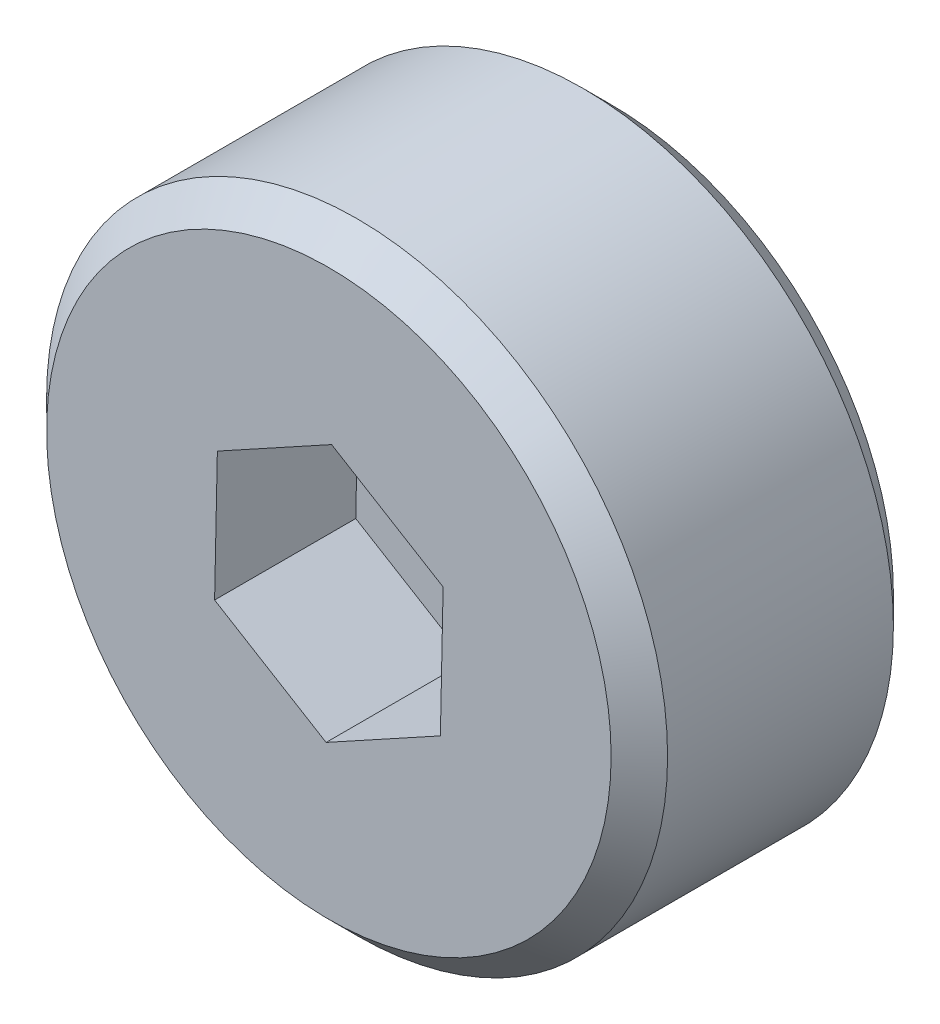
ISO-10303-21;
HEADER;
FILE_DESCRIPTION(('STEP AP214'),'2;1');
FILE_NAME('part.step','',(''),(''),'','','');
FILE_SCHEMA(('AUTOMOTIVE_DESIGN { 1 0 10303 214 1 1 1 1 }'));
ENDSEC;
DATA;
#1=APPLICATION_CONTEXT('core data for automotive mechanical design processes');
#2=APPLICATION_PROTOCOL_DEFINITION('international standard','automotive_design',2000,#1);
#3=PRODUCT_CONTEXT('',#1,'mechanical');
#4=PRODUCT('Part','Part','',(#3));
#5=PRODUCT_RELATED_PRODUCT_CATEGORY('part','',(#4));
#6=PRODUCT_DEFINITION_FORMATION('','',#4);
#7=PRODUCT_DEFINITION_CONTEXT('part definition',#1,'design');
#8=PRODUCT_DEFINITION('design','',#6,#7);
#9=PRODUCT_DEFINITION_SHAPE('','',#8);
#10=(LENGTH_UNIT() NAMED_UNIT(*) SI_UNIT(.MILLI.,.METRE.));
#11=(NAMED_UNIT(*) PLANE_ANGLE_UNIT() SI_UNIT($,.RADIAN.));
#12=(NAMED_UNIT(*) SI_UNIT($,.STERADIAN.) SOLID_ANGLE_UNIT());
#13=UNCERTAINTY_MEASURE_WITH_UNIT(LENGTH_MEASURE(1.E-05),#10,'distance_accuracy_value','');
#14=(GEOMETRIC_REPRESENTATION_CONTEXT(3) GLOBAL_UNCERTAINTY_ASSIGNED_CONTEXT((#13)) GLOBAL_UNIT_ASSIGNED_CONTEXT((#10,
#11,#12)) REPRESENTATION_CONTEXT('',''));
#15=CARTESIAN_POINT('',(0.,0.,0.));
#16=DIRECTION('',(0.,0.,1.));
#17=DIRECTION('',(1.,0.,0.));
#18=AXIS2_PLACEMENT_3D('',#15,#16,#17);
#19=CARTESIAN_POINT('',(0.,0.,10.));
#20=DIRECTION('',(0.,0.,-1.));
#21=DIRECTION('',(-1.,0.,0.));
#22=AXIS2_PLACEMENT_3D('',#19,#20,#21);
#23=CYLINDRICAL_SURFACE('',#22,11.);
#24=CARTESIAN_POINT('',(0.,0.,1.));
#25=DIRECTION('',(0.,0.,1.));
#26=DIRECTION('',(1.,0.,0.));
#27=AXIS2_PLACEMENT_3D('',#24,#25,#26);
#28=CIRCLE('',#27,11.);
#29=CARTESIAN_POINT('',(11.,0.,1.));
#30=VERTEX_POINT('',#29);
#31=EDGE_CURVE('E143',#30,#30,#28,.T.);
#32=ORIENTED_EDGE('',*,*,#31,.T.);
#33=EDGE_LOOP('',(#32));
#34=FACE_BOUND('',#33,.T.);
#35=CARTESIAN_POINT('',(0.,0.,8.99999999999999));
#36=DIRECTION('',(0.,0.,1.));
#37=DIRECTION('',(1.,0.,0.));
#38=AXIS2_PLACEMENT_3D('',#35,#36,#37);
#39=CIRCLE('',#38,11.);
#40=CARTESIAN_POINT('',(11.,0.,8.99999999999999));
#41=VERTEX_POINT('',#40);
#42=EDGE_CURVE('E135',#41,#41,#39,.F.);
#43=ORIENTED_EDGE('',*,*,#42,.T.);
#44=EDGE_LOOP('',(#43));
#45=FACE_BOUND('',#44,.T.);
#46=ADVANCED_FACE('F33',(#34,#45),#23,.T.);
#47=CARTESIAN_POINT('',(0.,0.,10.));
#48=DIRECTION('',(0.,0.,1.));
#49=DIRECTION('',(1.,0.,0.));
#50=AXIS2_PLACEMENT_3D('',#47,#48,#49);
#51=PLANE('',#50);
#52=CARTESIAN_POINT('',(0.,0.,10.));
#53=DIRECTION('',(0.,0.,1.));
#54=DIRECTION('',(1.,0.,0.));
#55=AXIS2_PLACEMENT_3D('',#52,#53,#54);
#56=CIRCLE('',#55,9.99999999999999);
#57=CARTESIAN_POINT('',(9.99999999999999,0.,10.));
#58=VERTEX_POINT('',#57);
#59=EDGE_CURVE('E11',#58,#58,#56,.T.);
#60=ORIENTED_EDGE('',*,*,#59,.T.);
#61=EDGE_LOOP('',(#60));
#62=FACE_BOUND('',#61,.T.);
#63=DIRECTION('',(-0.876389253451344,-0.481603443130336,0.));
#64=VECTOR('',#63,1.);
#65=CARTESIAN_POINT('',(0.0975205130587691,4.61777252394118,10.));
#66=LINE('',#65,#64);
#67=CARTESIAN_POINT('',(0.0975205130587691,4.61777252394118,10.));
#68=VERTEX_POINT('',#67);
#69=CARTESIAN_POINT('',(-3.95034805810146,2.39334150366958,10.));
#70=VERTEX_POINT('',#69);
#71=EDGE_CURVE('E48',#68,#70,#66,.T.);
#72=ORIENTED_EDGE('',*,*,#71,.F.);
#73=DIRECTION('',(-0.855275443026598,0.518173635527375,0.));
#74=VECTOR('',#73,1.);
#75=CARTESIAN_POINT('',(4.04786857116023,2.2244310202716,10.));
#76=LINE('',#75,#74);
#77=CARTESIAN_POINT('',(4.04786857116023,2.2244310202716,10.));
#78=VERTEX_POINT('',#77);
#79=EDGE_CURVE('E131',#78,#68,#76,.T.);
#80=ORIENTED_EDGE('',*,*,#79,.F.);
#81=DIRECTION('',(0.0211138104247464,0.999777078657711,0.));
#82=VECTOR('',#81,1.);
#83=CARTESIAN_POINT('',(3.95034805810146,-2.39334150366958,10.));
#84=LINE('',#83,#82);
#85=CARTESIAN_POINT('',(3.95034805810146,-2.39334150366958,10.));
#86=VERTEX_POINT('',#85);
#87=EDGE_CURVE('E129',#86,#78,#84,.T.);
#88=ORIENTED_EDGE('',*,*,#87,.F.);
#89=DIRECTION('',(0.876389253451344,0.481603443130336,0.));
#90=VECTOR('',#89,1.);
#91=CARTESIAN_POINT('',(-0.0975205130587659,-4.61777252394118,10.));
#92=LINE('',#91,#90);
#93=CARTESIAN_POINT('',(-0.0975205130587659,-4.61777252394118,10.));
#94=VERTEX_POINT('',#93);
#95=EDGE_CURVE('E96',#94,#86,#92,.T.);
#96=ORIENTED_EDGE('',*,*,#95,.F.);
#97=DIRECTION('',(0.855275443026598,-0.518173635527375,0.));
#98=VECTOR('',#97,1.);
#99=CARTESIAN_POINT('',(-4.04786857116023,-2.2244310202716,10.));
#100=LINE('',#99,#98);
#101=CARTESIAN_POINT('',(-4.04786857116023,-2.2244310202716,10.));
#102=VERTEX_POINT('',#101);
#103=EDGE_CURVE('E125',#102,#94,#100,.T.);
#104=ORIENTED_EDGE('',*,*,#103,.F.);
#105=DIRECTION('',(-0.0211138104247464,-0.999777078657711,0.));
#106=VECTOR('',#105,1.);
#107=CARTESIAN_POINT('',(-3.95034805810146,2.39334150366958,10.));
#108=LINE('',#107,#106);
#109=EDGE_CURVE('E122',#70,#102,#108,.T.);
#110=ORIENTED_EDGE('',*,*,#109,.F.);
#111=EDGE_LOOP('',(#72,#80,#88,#96,#104,#110));
#112=FACE_BOUND('',#111,.T.);
#113=ADVANCED_FACE('F157',(#62,#112),#51,.T.);
#114=CARTESIAN_POINT('',(0.,0.,0.));
#115=DIRECTION('',(0.,0.,1.));
#116=DIRECTION('',(1.,0.,0.));
#117=AXIS2_PLACEMENT_3D('',#114,#115,#116);
#118=PLANE('',#117);
#119=CARTESIAN_POINT('',(0.,0.,0.));
#120=DIRECTION('',(0.,0.,1.));
#121=DIRECTION('',(1.,0.,0.));
#122=AXIS2_PLACEMENT_3D('',#119,#120,#121);
#123=CIRCLE('',#122,9.99999999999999);
#124=CARTESIAN_POINT('',(9.99999999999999,0.,0.));
#125=VERTEX_POINT('',#124);
#126=EDGE_CURVE('E41',#125,#125,#123,.F.);
#127=ORIENTED_EDGE('',*,*,#126,.T.);
#128=EDGE_LOOP('',(#127));
#129=FACE_BOUND('',#128,.T.);
#130=ADVANCED_FACE('F148',(#129),#118,.F.);
#131=CARTESIAN_POINT('',(0.0975205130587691,4.61777252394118,5.));
#132=DIRECTION('',(-0.481603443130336,0.876389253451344,0.));
#133=DIRECTION('',(-0.876389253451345,-0.481603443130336,0.));
#134=AXIS2_PLACEMENT_3D('',#131,#132,#133);
#135=PLANE('',#134);
#136=ORIENTED_EDGE('',*,*,#71,.T.);
#137=DIRECTION('',(0.,0.,1.));
#138=VECTOR('',#137,1.);
#139=CARTESIAN_POINT('',(-3.95034805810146,2.39334150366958,5.));
#140=LINE('',#139,#138);
#141=CARTESIAN_POINT('',(-3.95034805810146,2.39334150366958,5.));
#142=VERTEX_POINT('',#141);
#143=EDGE_CURVE('E78',#142,#70,#140,.T.);
#144=ORIENTED_EDGE('',*,*,#143,.F.);
#145=DIRECTION('',(-0.876389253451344,-0.481603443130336,0.));
#146=VECTOR('',#145,1.);
#147=CARTESIAN_POINT('',(0.0975205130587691,4.61777252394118,5.));
#148=LINE('',#147,#146);
#149=CARTESIAN_POINT('',(0.0975205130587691,4.61777252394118,5.));
#150=VERTEX_POINT('',#149);
#151=EDGE_CURVE('E133',#150,#142,#148,.T.);
#152=ORIENTED_EDGE('',*,*,#151,.F.);
#153=DIRECTION('',(0.,0.,1.));
#154=VECTOR('',#153,1.);
#155=CARTESIAN_POINT('',(0.0975205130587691,4.61777252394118,5.));
#156=LINE('',#155,#154);
#157=EDGE_CURVE('E56',#150,#68,#156,.T.);
#158=ORIENTED_EDGE('',*,*,#157,.T.);
#159=EDGE_LOOP('',(#136,#144,#152,#158));
#160=FACE_BOUND('',#159,.T.);
#161=ADVANCED_FACE('F174',(#160),#135,.F.);
#162=CARTESIAN_POINT('',(4.04786857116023,2.2244310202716,5.));
#163=DIRECTION('',(0.518173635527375,0.855275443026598,0.));
#164=DIRECTION('',(-0.855275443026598,0.518173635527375,0.));
#165=AXIS2_PLACEMENT_3D('',#162,#163,#164);
#166=PLANE('',#165);
#167=ORIENTED_EDGE('',*,*,#79,.T.);
#168=ORIENTED_EDGE('',*,*,#157,.F.);
#169=DIRECTION('',(-0.855275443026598,0.518173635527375,0.));
#170=VECTOR('',#169,1.);
#171=CARTESIAN_POINT('',(4.04786857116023,2.2244310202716,5.));
#172=LINE('',#171,#170);
#173=CARTESIAN_POINT('',(4.04786857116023,2.2244310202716,5.));
#174=VERTEX_POINT('',#173);
#175=EDGE_CURVE('E108',#174,#150,#172,.T.);
#176=ORIENTED_EDGE('',*,*,#175,.F.);
#177=DIRECTION('',(0.,0.,1.));
#178=VECTOR('',#177,1.);
#179=CARTESIAN_POINT('',(4.04786857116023,2.2244310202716,5.));
#180=LINE('',#179,#178);
#181=EDGE_CURVE('E100',#174,#78,#180,.T.);
#182=ORIENTED_EDGE('',*,*,#181,.T.);
#183=EDGE_LOOP('',(#167,#168,#176,#182));
#184=FACE_BOUND('',#183,.T.);
#185=ADVANCED_FACE('F176',(#184),#166,.F.);
#186=CARTESIAN_POINT('',(3.95034805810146,-2.39334150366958,5.));
#187=DIRECTION('',(0.999777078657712,-0.0211138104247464,0.));
#188=DIRECTION('',(0.0211138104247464,0.999777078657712,0.));
#189=AXIS2_PLACEMENT_3D('',#186,#187,#188);
#190=PLANE('',#189);
#191=ORIENTED_EDGE('',*,*,#87,.T.);
#192=ORIENTED_EDGE('',*,*,#181,.F.);
#193=DIRECTION('',(0.0211138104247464,0.999777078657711,0.));
#194=VECTOR('',#193,1.);
#195=CARTESIAN_POINT('',(3.95034805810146,-2.39334150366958,5.));
#196=LINE('',#195,#194);
#197=CARTESIAN_POINT('',(3.95034805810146,-2.39334150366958,5.));
#198=VERTEX_POINT('',#197);
#199=EDGE_CURVE('E104',#198,#174,#196,.T.);
#200=ORIENTED_EDGE('',*,*,#199,.F.);
#201=DIRECTION('',(0.,0.,1.));
#202=VECTOR('',#201,1.);
#203=CARTESIAN_POINT('',(3.95034805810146,-2.39334150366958,5.));
#204=LINE('',#203,#202);
#205=EDGE_CURVE('E89',#198,#86,#204,.T.);
#206=ORIENTED_EDGE('',*,*,#205,.T.);
#207=EDGE_LOOP('',(#191,#192,#200,#206));
#208=FACE_BOUND('',#207,.T.);
#209=ADVANCED_FACE('F105',(#208),#190,.F.);
#210=CARTESIAN_POINT('',(-0.0975205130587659,-4.61777252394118,5.));
#211=DIRECTION('',(0.481603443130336,-0.876389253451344,0.));
#212=DIRECTION('',(0.876389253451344,0.481603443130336,0.));
#213=AXIS2_PLACEMENT_3D('',#210,#211,#212);
#214=PLANE('',#213);
#215=ORIENTED_EDGE('',*,*,#95,.T.);
#216=ORIENTED_EDGE('',*,*,#205,.F.);
#217=DIRECTION('',(0.876389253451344,0.481603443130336,0.));
#218=VECTOR('',#217,1.);
#219=CARTESIAN_POINT('',(-0.0975205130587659,-4.61777252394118,5.));
#220=LINE('',#219,#218);
#221=CARTESIAN_POINT('',(-0.0975205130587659,-4.61777252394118,5.));
#222=VERTEX_POINT('',#221);
#223=EDGE_CURVE('E93',#222,#198,#220,.T.);
#224=ORIENTED_EDGE('',*,*,#223,.F.);
#225=DIRECTION('',(0.,0.,1.));
#226=VECTOR('',#225,1.);
#227=CARTESIAN_POINT('',(-0.0975205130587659,-4.61777252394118,5.));
#228=LINE('',#227,#226);
#229=EDGE_CURVE('E101',#222,#94,#228,.T.);
#230=ORIENTED_EDGE('',*,*,#229,.T.);
#231=EDGE_LOOP('',(#215,#216,#224,#230));
#232=FACE_BOUND('',#231,.T.);
#233=ADVANCED_FACE('F91',(#232),#214,.F.);
#234=CARTESIAN_POINT('',(-4.04786857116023,-2.2244310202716,5.));
#235=DIRECTION('',(-0.518173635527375,-0.855275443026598,0.));
#236=DIRECTION('',(0.855275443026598,-0.518173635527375,0.));
#237=AXIS2_PLACEMENT_3D('',#234,#235,#236);
#238=PLANE('',#237);
#239=ORIENTED_EDGE('',*,*,#103,.T.);
#240=ORIENTED_EDGE('',*,*,#229,.F.);
#241=DIRECTION('',(0.855275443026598,-0.518173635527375,0.));
#242=VECTOR('',#241,1.);
#243=CARTESIAN_POINT('',(-4.04786857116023,-2.2244310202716,5.));
#244=LINE('',#243,#242);
#245=CARTESIAN_POINT('',(-4.04786857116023,-2.2244310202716,5.));
#246=VERTEX_POINT('',#245);
#247=EDGE_CURVE('E114',#246,#222,#244,.T.);
#248=ORIENTED_EDGE('',*,*,#247,.F.);
#249=DIRECTION('',(0.,0.,1.));
#250=VECTOR('',#249,1.);
#251=CARTESIAN_POINT('',(-4.04786857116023,-2.2244310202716,5.));
#252=LINE('',#251,#250);
#253=EDGE_CURVE('E138',#246,#102,#252,.T.);
#254=ORIENTED_EDGE('',*,*,#253,.T.);
#255=EDGE_LOOP('',(#239,#240,#248,#254));
#256=FACE_BOUND('',#255,.T.);
#257=ADVANCED_FACE('F187',(#256),#238,.F.);
#258=CARTESIAN_POINT('',(-3.95034805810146,2.39334150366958,5.));
#259=DIRECTION('',(-0.999777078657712,0.0211138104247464,0.));
#260=DIRECTION('',(-0.0211138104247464,-0.999777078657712,0.));
#261=AXIS2_PLACEMENT_3D('',#258,#259,#260);
#262=PLANE('',#261);
#263=ORIENTED_EDGE('',*,*,#109,.T.);
#264=ORIENTED_EDGE('',*,*,#253,.F.);
#265=DIRECTION('',(-0.0211138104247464,-0.999777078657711,0.));
#266=VECTOR('',#265,1.);
#267=CARTESIAN_POINT('',(-3.95034805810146,2.39334150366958,5.));
#268=LINE('',#267,#266);
#269=EDGE_CURVE('E116',#142,#246,#268,.T.);
#270=ORIENTED_EDGE('',*,*,#269,.F.);
#271=ORIENTED_EDGE('',*,*,#143,.T.);
#272=EDGE_LOOP('',(#263,#264,#270,#271));
#273=FACE_BOUND('',#272,.T.);
#274=ADVANCED_FACE('F172',(#273),#262,.F.);
#275=CARTESIAN_POINT('',(0.,0.,5.));
#276=DIRECTION('',(0.,0.,1.));
#277=DIRECTION('',(1.,0.,0.));
#278=AXIS2_PLACEMENT_3D('',#275,#276,#277);
#279=PLANE('',#278);
#280=ORIENTED_EDGE('',*,*,#151,.T.);
#281=ORIENTED_EDGE('',*,*,#269,.T.);
#282=ORIENTED_EDGE('',*,*,#247,.T.);
#283=ORIENTED_EDGE('',*,*,#223,.T.);
#284=ORIENTED_EDGE('',*,*,#199,.T.);
#285=ORIENTED_EDGE('',*,*,#175,.T.);
#286=EDGE_LOOP('',(#280,#281,#282,#283,#284,#285));
#287=FACE_BOUND('',#286,.T.);
#288=ADVANCED_FACE('F111',(#287),#279,.T.);
#289=CARTESIAN_POINT('',(0.,0.,1.));
#290=DIRECTION('',(0.,0.,1.));
#291=DIRECTION('',(1.,0.,0.));
#292=AXIS2_PLACEMENT_3D('',#289,#290,#291);
#293=CONICAL_SURFACE('',#292,11.,0.78539816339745);
#294=ORIENTED_EDGE('',*,*,#126,.F.);
#295=EDGE_LOOP('',(#294));
#296=FACE_BOUND('',#295,.T.);
#297=ORIENTED_EDGE('',*,*,#31,.F.);
#298=EDGE_LOOP('',(#297));
#299=FACE_BOUND('',#298,.T.);
#300=ADVANCED_FACE('F150',(#296,#299),#293,.T.);
#301=CARTESIAN_POINT('',(0.,0.,10.));
#302=DIRECTION('',(0.,0.,-1.));
#303=DIRECTION('',(-1.,0.,0.));
#304=AXIS2_PLACEMENT_3D('',#301,#302,#303);
#305=CONICAL_SURFACE('',#304,9.99999999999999,0.785398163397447);
#306=ORIENTED_EDGE('',*,*,#42,.F.);
#307=EDGE_LOOP('',(#306));
#308=FACE_BOUND('',#307,.T.);
#309=ORIENTED_EDGE('',*,*,#59,.F.);
#310=EDGE_LOOP('',(#309));
#311=FACE_BOUND('',#310,.T.);
#312=ADVANCED_FACE('F35',(#308,#311),#305,.T.);
#313=CLOSED_SHELL('',(#46,#113,#130,#161,#185,#209,#233,#257,#274,#288,#300,#312));
#314=MANIFOLD_SOLID_BREP('B2',#313);
#315=ADVANCED_BREP_SHAPE_REPRESENTATION('',(#18,#314),#14);
#316=SHAPE_DEFINITION_REPRESENTATION(#9,#315);
ENDSEC;
END-ISO-10303-21;
